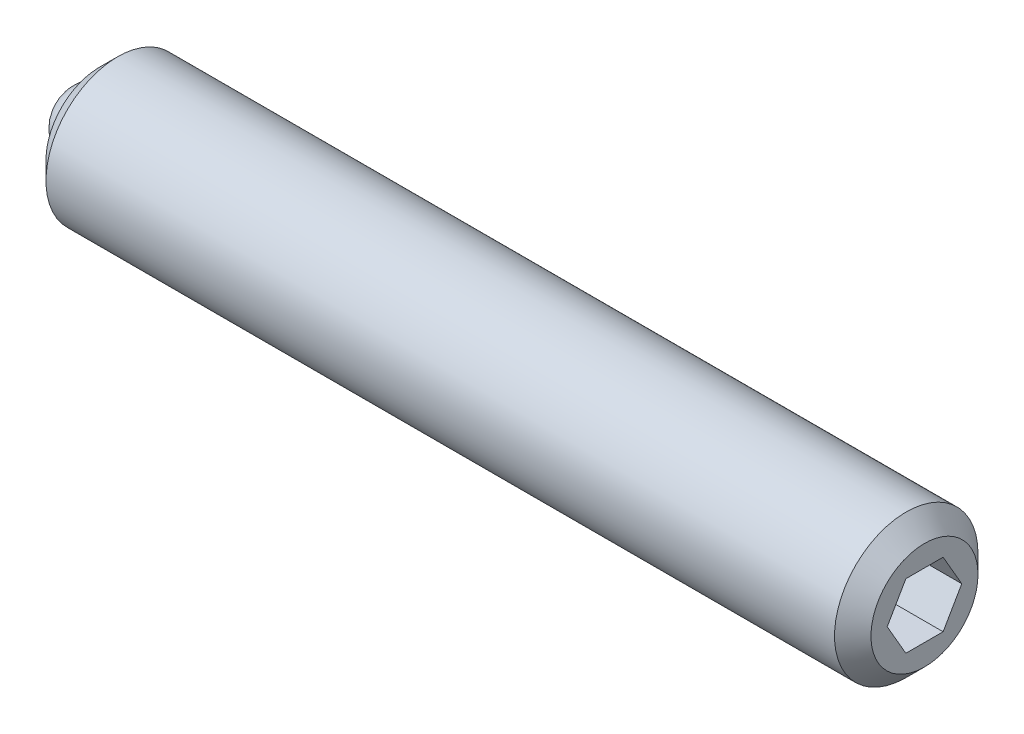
from build123d import *

# Parameters (mm, degrees)
SKETCH2_R           = 1
BOSS_EXTRUDE1_DEPTH = 11.5
CHAMFER1_SIZE       = 0.254
CHAMFER2_SIZE       = 0.254
CUT_EXTRUDE2_DEPTH  = 2
SKETCH3_R           = 0.5
CUT_EXTRUDE3_DEPTH  = 0.5


with BuildPart() as part:
    # Sketch2 → Boss-Extrude1 (new body)
    with BuildSketch(Plane(origin=(0, 0, 0), x_dir=(0, 0, -1), z_dir=(1, 0, 0))):
        Circle(SKETCH2_R)
    extrude(amount=BOSS_EXTRUDE1_DEPTH)

    # Chamfer1
    chamfer1_edges = [part.edges().sort_by_distance(p)[0] for p in [
        (0, 0, 1),
    ]]
    chamfer(chamfer1_edges, length=CHAMFER1_SIZE)

    # Chamfer2
    chamfer2_edges = [part.edges().sort_by_distance(p)[0] for p in [
        (11.5, 0, 1),
    ]]
    chamfer(chamfer2_edges, length=CHAMFER2_SIZE)

    # Sketch4 → Cut-Extrude2 (cut)
    with BuildSketch(Plane(origin=(11.5, 0, 0), x_dir=(0, 0, -1), z_dir=(1, 0, 0))):
        Polygon((0.519615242, 0), (0.259807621, 0.45), (-0.259807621, 0.45), (-0.519615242, 0), (-0.259807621, -0.45), (0.259807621, -0.45), align=None)
    extrude(amount=-CUT_EXTRUDE2_DEPTH, mode=Mode.SUBTRACT)

    # Sketch3 → Cut-Extrude3 (cut)
    with BuildSketch(Plane.ZY):
        Circle(SKETCH3_R)
    extrude(amount=-CUT_EXTRUDE3_DEPTH, mode=Mode.SUBTRACT)


with BuildPart() as body_2:
    # Sketch5 → Revolve1 (revolve)
    with BuildSketch(Plane.ZY):
        with BuildLine():
            Line((0, 0), (0, -0.5))
            ThreePointArc((0, -0.5), (-0.5, 0), (0, 0.5))
            Line((0, 0.5), (0, 0))
        make_face()
    revolve(axis=Axis((0, 0, 0), (0, 1, 0)))


solid = Compound([part.part, body_2.part])
